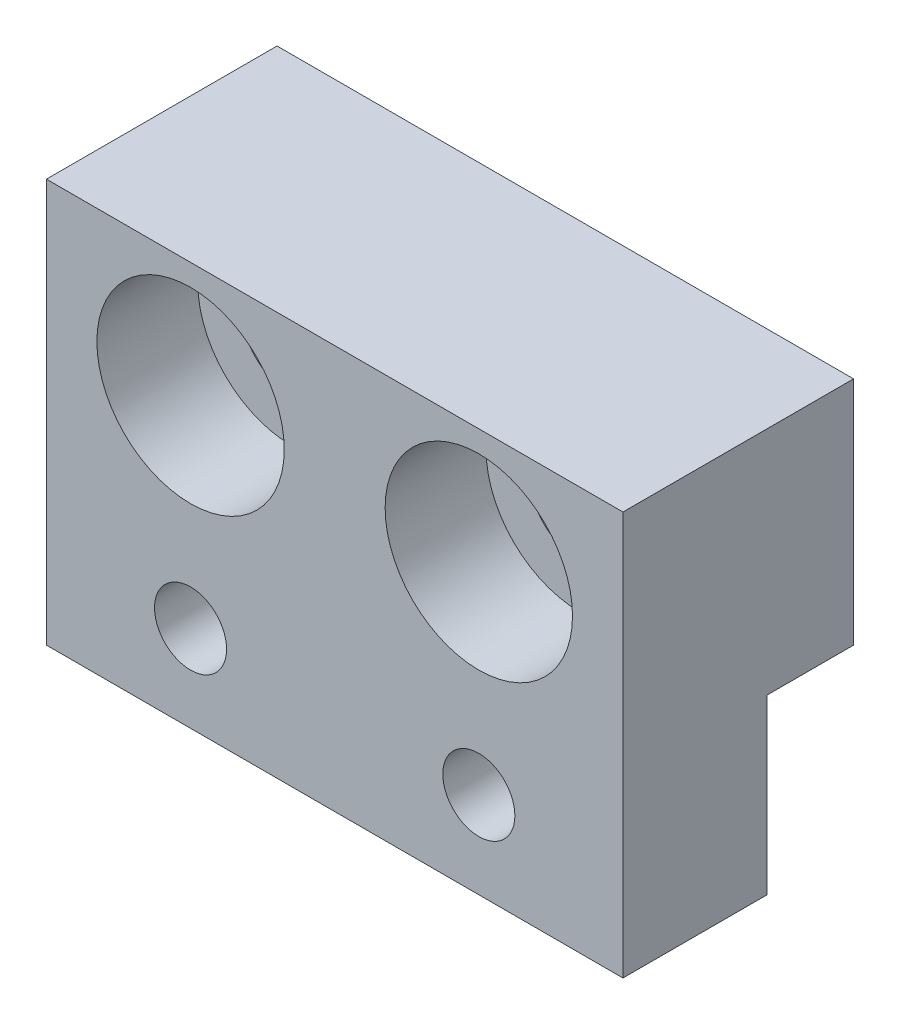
ISO-10303-21;
HEADER;
FILE_DESCRIPTION(('STEP AP214'),'2;1');
FILE_NAME('part.step','',(''),(''),'','','');
FILE_SCHEMA(('AUTOMOTIVE_DESIGN { 1 0 10303 214 1 1 1 1 }'));
ENDSEC;
DATA;
#1=APPLICATION_CONTEXT('core data for automotive mechanical design processes');
#2=APPLICATION_PROTOCOL_DEFINITION('international standard','automotive_design',2000,#1);
#3=PRODUCT_CONTEXT('',#1,'mechanical');
#4=PRODUCT('Part','Part','',(#3));
#5=PRODUCT_RELATED_PRODUCT_CATEGORY('part','',(#4));
#6=PRODUCT_DEFINITION_FORMATION('','',#4);
#7=PRODUCT_DEFINITION_CONTEXT('part definition',#1,'design');
#8=PRODUCT_DEFINITION('design','',#6,#7);
#9=PRODUCT_DEFINITION_SHAPE('','',#8);
#10=(LENGTH_UNIT() NAMED_UNIT(*) SI_UNIT(.MILLI.,.METRE.));
#11=(NAMED_UNIT(*) PLANE_ANGLE_UNIT() SI_UNIT($,.RADIAN.));
#12=(NAMED_UNIT(*) SI_UNIT($,.STERADIAN.) SOLID_ANGLE_UNIT());
#13=UNCERTAINTY_MEASURE_WITH_UNIT(LENGTH_MEASURE(1.E-05),#10,'distance_accuracy_value','');
#14=(GEOMETRIC_REPRESENTATION_CONTEXT(3) GLOBAL_UNCERTAINTY_ASSIGNED_CONTEXT((#13)) GLOBAL_UNIT_ASSIGNED_CONTEXT((#10,
#11,#12)) REPRESENTATION_CONTEXT('',''));
#15=CARTESIAN_POINT('',(0.,0.,0.));
#16=DIRECTION('',(0.,0.,1.));
#17=DIRECTION('',(1.,0.,0.));
#18=AXIS2_PLACEMENT_3D('',#15,#16,#17);
#19=CARTESIAN_POINT('',(4.54747350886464E-13,14.,0.));
#20=DIRECTION('',(0.,0.,-1.));
#21=DIRECTION('',(-1.,0.,0.));
#22=AXIS2_PLACEMENT_3D('',#19,#20,#21);
#23=PLANE('',#22);
#24=CARTESIAN_POINT('',(5.00000000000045,10.0000000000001,0.));
#25=DIRECTION('',(0.,0.,1.));
#26=DIRECTION('',(1.,0.,0.));
#27=AXIS2_PLACEMENT_3D('',#24,#25,#26);
#28=CIRCLE('',#27,1.75);
#29=CARTESIAN_POINT('',(6.75000000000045,10.0000000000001,0.));
#30=VERTEX_POINT('',#29);
#31=EDGE_CURVE('E145',#30,#30,#28,.T.);
#32=ORIENTED_EDGE('',*,*,#31,.T.);
#33=EDGE_LOOP('',(#32));
#34=FACE_BOUND('',#33,.T.);
#35=CARTESIAN_POINT('',(15.0000000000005,10.0000000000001,0.));
#36=DIRECTION('',(0.,0.,1.));
#37=DIRECTION('',(1.,0.,0.));
#38=AXIS2_PLACEMENT_3D('',#35,#36,#37);
#39=CIRCLE('',#38,1.75);
#40=CARTESIAN_POINT('',(16.7500000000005,10.0000000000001,0.));
#41=VERTEX_POINT('',#40);
#42=EDGE_CURVE('E148',#41,#41,#39,.T.);
#43=ORIENTED_EDGE('',*,*,#42,.T.);
#44=EDGE_LOOP('',(#43));
#45=FACE_BOUND('',#44,.T.);
#46=DIRECTION('',(0.,1.,0.));
#47=VECTOR('',#46,1.);
#48=CARTESIAN_POINT('',(20.0000000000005,0.,0.));
#49=LINE('',#48,#47);
#50=CARTESIAN_POINT('',(20.0000000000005,5.99999999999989,0.));
#51=VERTEX_POINT('',#50);
#52=CARTESIAN_POINT('',(20.0000000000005,14.,0.));
#53=VERTEX_POINT('',#52);
#54=EDGE_CURVE('E159',#51,#53,#49,.T.);
#55=ORIENTED_EDGE('',*,*,#54,.F.);
#56=DIRECTION('',(1.,0.,0.));
#57=VECTOR('',#56,1.);
#58=CARTESIAN_POINT('',(4.54497550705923E-13,5.99999999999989,0.));
#59=LINE('',#58,#57);
#60=CARTESIAN_POINT('',(4.54497550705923E-13,5.99999999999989,0.));
#61=VERTEX_POINT('',#60);
#62=EDGE_CURVE('E102',#61,#51,#59,.T.);
#63=ORIENTED_EDGE('',*,*,#62,.F.);
#64=DIRECTION('',(0.,-1.,0.));
#65=VECTOR('',#64,1.);
#66=CARTESIAN_POINT('',(4.54747350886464E-13,0.,0.));
#67=LINE('',#66,#65);
#68=CARTESIAN_POINT('',(4.54747350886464E-13,14.,0.));
#69=VERTEX_POINT('',#68);
#70=EDGE_CURVE('E114',#69,#61,#67,.T.);
#71=ORIENTED_EDGE('',*,*,#70,.F.);
#72=DIRECTION('',(-1.,0.,0.));
#73=VECTOR('',#72,1.);
#74=CARTESIAN_POINT('',(4.54747350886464E-13,14.,0.));
#75=LINE('',#74,#73);
#76=EDGE_CURVE('E74',#53,#69,#75,.T.);
#77=ORIENTED_EDGE('',*,*,#76,.F.);
#78=EDGE_LOOP('',(#55,#63,#71,#77));
#79=FACE_BOUND('',#78,.T.);
#80=ADVANCED_FACE('F33',(#34,#45,#79),#23,.T.);
#81=CARTESIAN_POINT('',(4.54747350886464E-13,0.,8.));
#82=DIRECTION('',(1.,0.,0.));
#83=DIRECTION('',(0.,0.,-1.));
#84=AXIS2_PLACEMENT_3D('',#81,#82,#83);
#85=PLANE('',#84);
#86=DIRECTION('',(0.,0.,-1.));
#87=VECTOR('',#86,1.);
#88=CARTESIAN_POINT('',(4.54497550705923E-13,5.99999999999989,3.));
#89=LINE('',#88,#87);
#90=CARTESIAN_POINT('',(4.54497550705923E-13,5.99999999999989,3.));
#91=VERTEX_POINT('',#90);
#92=EDGE_CURVE('E98',#91,#61,#89,.T.);
#93=ORIENTED_EDGE('',*,*,#92,.F.);
#94=DIRECTION('',(0.,1.,0.));
#95=VECTOR('',#94,1.);
#96=CARTESIAN_POINT('',(4.54497550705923E-13,-1.13686837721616E-13,3.));
#97=LINE('',#96,#95);
#98=CARTESIAN_POINT('',(4.54497550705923E-13,-1.13624387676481E-13,3.));
#99=VERTEX_POINT('',#98);
#100=EDGE_CURVE('E106',#99,#91,#97,.T.);
#101=ORIENTED_EDGE('',*,*,#100,.F.);
#102=DIRECTION('',(0.,0.,-1.));
#103=VECTOR('',#102,1.);
#104=CARTESIAN_POINT('',(4.54747350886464E-13,0.,8.));
#105=LINE('',#104,#103);
#106=CARTESIAN_POINT('',(4.54747350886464E-13,0.,8.));
#107=VERTEX_POINT('',#106);
#108=EDGE_CURVE('E12',#107,#99,#105,.T.);
#109=ORIENTED_EDGE('',*,*,#108,.F.);
#110=DIRECTION('',(0.,-1.,0.));
#111=VECTOR('',#110,1.);
#112=CARTESIAN_POINT('',(4.54747350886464E-13,0.,8.));
#113=LINE('',#112,#111);
#114=CARTESIAN_POINT('',(4.54747350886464E-13,14.,8.));
#115=VERTEX_POINT('',#114);
#116=EDGE_CURVE('E151',#115,#107,#113,.T.);
#117=ORIENTED_EDGE('',*,*,#116,.F.);
#118=DIRECTION('',(0.,0.,-1.));
#119=VECTOR('',#118,1.);
#120=CARTESIAN_POINT('',(4.54747350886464E-13,14.,8.));
#121=LINE('',#120,#119);
#122=EDGE_CURVE('E157',#115,#69,#121,.T.);
#123=ORIENTED_EDGE('',*,*,#122,.T.);
#124=ORIENTED_EDGE('',*,*,#70,.T.);
#125=EDGE_LOOP('',(#93,#101,#109,#117,#123,#124));
#126=FACE_BOUND('',#125,.T.);
#127=ADVANCED_FACE('F35',(#126),#85,.F.);
#128=CARTESIAN_POINT('',(4.54747350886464E-13,0.,8.));
#129=DIRECTION('',(0.,1.,0.));
#130=DIRECTION('',(0.,0.,1.));
#131=AXIS2_PLACEMENT_3D('',#128,#129,#130);
#132=PLANE('',#131);
#133=DIRECTION('',(1.,0.,0.));
#134=VECTOR('',#133,1.);
#135=CARTESIAN_POINT('',(4.54497550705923E-13,-1.13686837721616E-13,3.));
#136=LINE('',#135,#134);
#137=CARTESIAN_POINT('',(20.0000000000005,-1.13686837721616E-13,3.));
#138=VERTEX_POINT('',#137);
#139=EDGE_CURVE('E103',#99,#138,#136,.T.);
#140=ORIENTED_EDGE('',*,*,#139,.T.);
#141=DIRECTION('',(0.,0.,-1.));
#142=VECTOR('',#141,1.);
#143=CARTESIAN_POINT('',(20.0000000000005,0.,8.));
#144=LINE('',#143,#142);
#145=CARTESIAN_POINT('',(20.0000000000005,0.,8.));
#146=VERTEX_POINT('',#145);
#147=EDGE_CURVE('E42',#146,#138,#144,.T.);
#148=ORIENTED_EDGE('',*,*,#147,.F.);
#149=DIRECTION('',(1.,0.,0.));
#150=VECTOR('',#149,1.);
#151=CARTESIAN_POINT('',(4.54747350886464E-13,0.,8.));
#152=LINE('',#151,#150);
#153=EDGE_CURVE('E81',#107,#146,#152,.T.);
#154=ORIENTED_EDGE('',*,*,#153,.F.);
#155=ORIENTED_EDGE('',*,*,#108,.T.);
#156=EDGE_LOOP('',(#140,#148,#154,#155));
#157=FACE_BOUND('',#156,.T.);
#158=ADVANCED_FACE('F221',(#157),#132,.F.);
#159=CARTESIAN_POINT('',(20.0000000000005,0.,8.));
#160=DIRECTION('',(-1.,0.,0.));
#161=DIRECTION('',(0.,0.,1.));
#162=AXIS2_PLACEMENT_3D('',#159,#160,#161);
#163=PLANE('',#162);
#164=DIRECTION('',(0.,0.,-1.));
#165=VECTOR('',#164,1.);
#166=CARTESIAN_POINT('',(20.0000000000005,5.99999999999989,3.));
#167=LINE('',#166,#165);
#168=CARTESIAN_POINT('',(20.0000000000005,5.99999999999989,3.));
#169=VERTEX_POINT('',#168);
#170=EDGE_CURVE('E50',#169,#51,#167,.T.);
#171=ORIENTED_EDGE('',*,*,#170,.T.);
#172=ORIENTED_EDGE('',*,*,#54,.T.);
#173=DIRECTION('',(0.,0.,-1.));
#174=VECTOR('',#173,1.);
#175=CARTESIAN_POINT('',(20.0000000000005,14.,8.));
#176=LINE('',#175,#174);
#177=CARTESIAN_POINT('',(20.0000000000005,14.,8.));
#178=VERTEX_POINT('',#177);
#179=EDGE_CURVE('E163',#178,#53,#176,.T.);
#180=ORIENTED_EDGE('',*,*,#179,.F.);
#181=DIRECTION('',(0.,1.,0.));
#182=VECTOR('',#181,1.);
#183=CARTESIAN_POINT('',(20.0000000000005,0.,8.));
#184=LINE('',#183,#182);
#185=EDGE_CURVE('E154',#146,#178,#184,.T.);
#186=ORIENTED_EDGE('',*,*,#185,.F.);
#187=ORIENTED_EDGE('',*,*,#147,.T.);
#188=DIRECTION('',(0.,1.,0.));
#189=VECTOR('',#188,1.);
#190=CARTESIAN_POINT('',(20.0000000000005,-1.13686837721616E-13,3.));
#191=LINE('',#190,#189);
#192=EDGE_CURVE('E118',#138,#169,#191,.T.);
#193=ORIENTED_EDGE('',*,*,#192,.T.);
#194=EDGE_LOOP('',(#171,#172,#180,#186,#187,#193));
#195=FACE_BOUND('',#194,.T.);
#196=ADVANCED_FACE('F228',(#195),#163,.F.);
#197=CARTESIAN_POINT('',(5.00000000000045,3.,8.));
#198=DIRECTION('',(0.,0.,-1.));
#199=DIRECTION('',(-1.,0.,0.));
#200=AXIS2_PLACEMENT_3D('',#197,#198,#199);
#201=CYLINDRICAL_SURFACE('',#200,1.25);
#202=CARTESIAN_POINT('',(5.00000000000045,3.,8.));
#203=DIRECTION('',(0.,0.,1.));
#204=DIRECTION('',(1.,0.,0.));
#205=AXIS2_PLACEMENT_3D('',#202,#203,#204);
#206=CIRCLE('',#205,1.25);
#207=CARTESIAN_POINT('',(6.25000000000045,3.,8.));
#208=VERTEX_POINT('',#207);
#209=EDGE_CURVE('E142',#208,#208,#206,.T.);
#210=ORIENTED_EDGE('',*,*,#209,.T.);
#211=EDGE_LOOP('',(#210));
#212=FACE_BOUND('',#211,.T.);
#213=CARTESIAN_POINT('',(5.00000000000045,3.,3.));
#214=DIRECTION('',(0.,0.,-1.));
#215=DIRECTION('',(-1.,0.,0.));
#216=AXIS2_PLACEMENT_3D('',#213,#214,#215);
#217=CIRCLE('',#216,1.25);
#218=CARTESIAN_POINT('',(3.75000000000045,3.,3.));
#219=VERTEX_POINT('',#218);
#220=EDGE_CURVE('E122',#219,#219,#217,.T.);
#221=ORIENTED_EDGE('',*,*,#220,.T.);
#222=EDGE_LOOP('',(#221));
#223=FACE_BOUND('',#222,.T.);
#224=ADVANCED_FACE('F202',(#212,#223),#201,.F.);
#225=CARTESIAN_POINT('',(15.0000000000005,3.,8.));
#226=DIRECTION('',(0.,0.,-1.));
#227=DIRECTION('',(-1.,0.,0.));
#228=AXIS2_PLACEMENT_3D('',#225,#226,#227);
#229=CYLINDRICAL_SURFACE('',#228,1.25);
#230=CARTESIAN_POINT('',(15.0000000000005,3.,8.));
#231=DIRECTION('',(0.,0.,1.));
#232=DIRECTION('',(1.,0.,0.));
#233=AXIS2_PLACEMENT_3D('',#230,#231,#232);
#234=CIRCLE('',#233,1.25);
#235=CARTESIAN_POINT('',(16.2500000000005,3.,8.));
#236=VERTEX_POINT('',#235);
#237=EDGE_CURVE('E139',#236,#236,#234,.T.);
#238=ORIENTED_EDGE('',*,*,#237,.T.);
#239=EDGE_LOOP('',(#238));
#240=FACE_BOUND('',#239,.T.);
#241=CARTESIAN_POINT('',(15.0000000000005,3.,3.));
#242=DIRECTION('',(0.,0.,-1.));
#243=DIRECTION('',(-1.,0.,0.));
#244=AXIS2_PLACEMENT_3D('',#241,#242,#243);
#245=CIRCLE('',#244,1.25);
#246=CARTESIAN_POINT('',(13.7500000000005,3.,3.));
#247=VERTEX_POINT('',#246);
#248=EDGE_CURVE('E37',#247,#247,#245,.T.);
#249=ORIENTED_EDGE('',*,*,#248,.T.);
#250=EDGE_LOOP('',(#249));
#251=FACE_BOUND('',#250,.T.);
#252=ADVANCED_FACE('F199',(#240,#251),#229,.F.);
#253=CARTESIAN_POINT('',(5.00000000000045,10.0000000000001,8.));
#254=DIRECTION('',(0.,0.,-1.));
#255=DIRECTION('',(-1.,0.,0.));
#256=AXIS2_PLACEMENT_3D('',#253,#254,#255);
#257=CYLINDRICAL_SURFACE('',#256,1.75);
#258=ORIENTED_EDGE('',*,*,#31,.F.);
#259=EDGE_LOOP('',(#258));
#260=FACE_BOUND('',#259,.T.);
#261=CARTESIAN_POINT('',(5.00000000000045,10.0000000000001,4.5));
#262=DIRECTION('',(0.,0.,1.));
#263=DIRECTION('',(1.,0.,0.));
#264=AXIS2_PLACEMENT_3D('',#261,#262,#263);
#265=CIRCLE('',#264,1.75);
#266=CARTESIAN_POINT('',(6.75000000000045,10.0000000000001,4.5));
#267=VERTEX_POINT('',#266);
#268=EDGE_CURVE('E129',#267,#267,#265,.T.);
#269=ORIENTED_EDGE('',*,*,#268,.T.);
#270=EDGE_LOOP('',(#269));
#271=FACE_BOUND('',#270,.T.);
#272=ADVANCED_FACE('F171',(#260,#271),#257,.F.);
#273=CARTESIAN_POINT('',(15.0000000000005,10.0000000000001,8.));
#274=DIRECTION('',(0.,0.,-1.));
#275=DIRECTION('',(-1.,0.,0.));
#276=AXIS2_PLACEMENT_3D('',#273,#274,#275);
#277=CYLINDRICAL_SURFACE('',#276,1.75);
#278=ORIENTED_EDGE('',*,*,#42,.F.);
#279=EDGE_LOOP('',(#278));
#280=FACE_BOUND('',#279,.T.);
#281=CARTESIAN_POINT('',(15.0000000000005,10.0000000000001,4.5));
#282=DIRECTION('',(0.,0.,1.));
#283=DIRECTION('',(1.,0.,0.));
#284=AXIS2_PLACEMENT_3D('',#281,#282,#283);
#285=CIRCLE('',#284,1.75);
#286=CARTESIAN_POINT('',(16.7500000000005,10.0000000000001,4.5));
#287=VERTEX_POINT('',#286);
#288=EDGE_CURVE('E135',#287,#287,#285,.T.);
#289=ORIENTED_EDGE('',*,*,#288,.T.);
#290=EDGE_LOOP('',(#289));
#291=FACE_BOUND('',#290,.T.);
#292=ADVANCED_FACE('F190',(#280,#291),#277,.F.);
#293=CARTESIAN_POINT('',(4.54747350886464E-13,14.,8.));
#294=DIRECTION('',(0.,0.,-1.));
#295=DIRECTION('',(-1.,0.,0.));
#296=AXIS2_PLACEMENT_3D('',#293,#294,#295);
#297=PLANE('',#296);
#298=CARTESIAN_POINT('',(5.00000000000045,10.0000000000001,8.));
#299=DIRECTION('',(0.,0.,1.));
#300=DIRECTION('',(1.,0.,0.));
#301=AXIS2_PLACEMENT_3D('',#298,#299,#300);
#302=CIRCLE('',#301,3.25);
#303=CARTESIAN_POINT('',(8.25000000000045,10.0000000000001,8.));
#304=VERTEX_POINT('',#303);
#305=EDGE_CURVE('E125',#304,#304,#302,.T.);
#306=ORIENTED_EDGE('',*,*,#305,.F.);
#307=EDGE_LOOP('',(#306));
#308=FACE_BOUND('',#307,.T.);
#309=CARTESIAN_POINT('',(15.0000000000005,10.0000000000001,8.));
#310=DIRECTION('',(0.,0.,1.));
#311=DIRECTION('',(1.,0.,0.));
#312=AXIS2_PLACEMENT_3D('',#309,#310,#311);
#313=CIRCLE('',#312,3.25);
#314=CARTESIAN_POINT('',(18.2500000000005,10.0000000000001,8.));
#315=VERTEX_POINT('',#314);
#316=EDGE_CURVE('E136',#315,#315,#313,.T.);
#317=ORIENTED_EDGE('',*,*,#316,.F.);
#318=EDGE_LOOP('',(#317));
#319=FACE_BOUND('',#318,.T.);
#320=ORIENTED_EDGE('',*,*,#209,.F.);
#321=EDGE_LOOP('',(#320));
#322=FACE_BOUND('',#321,.T.);
#323=ORIENTED_EDGE('',*,*,#116,.T.);
#324=ORIENTED_EDGE('',*,*,#153,.T.);
#325=ORIENTED_EDGE('',*,*,#185,.T.);
#326=DIRECTION('',(-1.,0.,0.));
#327=VECTOR('',#326,1.);
#328=CARTESIAN_POINT('',(4.54747350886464E-13,14.,8.));
#329=LINE('',#328,#327);
#330=EDGE_CURVE('E59',#178,#115,#329,.T.);
#331=ORIENTED_EDGE('',*,*,#330,.T.);
#332=EDGE_LOOP('',(#323,#324,#325,#331));
#333=FACE_BOUND('',#332,.T.);
#334=ORIENTED_EDGE('',*,*,#237,.F.);
#335=EDGE_LOOP('',(#334));
#336=FACE_BOUND('',#335,.T.);
#337=ADVANCED_FACE('F186',(#308,#319,#322,#333,#336),#297,.F.);
#338=CARTESIAN_POINT('',(4.54747350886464E-13,14.,8.));
#339=DIRECTION('',(0.,-1.,0.));
#340=DIRECTION('',(0.,0.,-1.));
#341=AXIS2_PLACEMENT_3D('',#338,#339,#340);
#342=PLANE('',#341);
#343=ORIENTED_EDGE('',*,*,#76,.T.);
#344=ORIENTED_EDGE('',*,*,#122,.F.);
#345=ORIENTED_EDGE('',*,*,#330,.F.);
#346=ORIENTED_EDGE('',*,*,#179,.T.);
#347=EDGE_LOOP('',(#343,#344,#345,#346));
#348=FACE_BOUND('',#347,.T.);
#349=ADVANCED_FACE('F189',(#348),#342,.F.);
#350=CARTESIAN_POINT('',(15.0000000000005,10.0000000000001,4.5));
#351=DIRECTION('',(0.,0.,1.));
#352=DIRECTION('',(1.,0.,0.));
#353=AXIS2_PLACEMENT_3D('',#350,#351,#352);
#354=CYLINDRICAL_SURFACE('',#353,3.25);
#355=CARTESIAN_POINT('',(15.0000000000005,10.0000000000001,4.5));
#356=DIRECTION('',(0.,0.,1.));
#357=DIRECTION('',(1.,0.,0.));
#358=AXIS2_PLACEMENT_3D('',#355,#356,#357);
#359=CIRCLE('',#358,3.25);
#360=CARTESIAN_POINT('',(18.2500000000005,10.0000000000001,4.5));
#361=VERTEX_POINT('',#360);
#362=EDGE_CURVE('E132',#361,#361,#359,.T.);
#363=ORIENTED_EDGE('',*,*,#362,.F.);
#364=EDGE_LOOP('',(#363));
#365=FACE_BOUND('',#364,.T.);
#366=ORIENTED_EDGE('',*,*,#316,.T.);
#367=EDGE_LOOP('',(#366));
#368=FACE_BOUND('',#367,.T.);
#369=ADVANCED_FACE('F227',(#365,#368),#354,.F.);
#370=CARTESIAN_POINT('',(15.0000000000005,10.0000000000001,4.5));
#371=DIRECTION('',(0.,0.,1.));
#372=DIRECTION('',(1.,0.,0.));
#373=AXIS2_PLACEMENT_3D('',#370,#371,#372);
#374=PLANE('',#373);
#375=ORIENTED_EDGE('',*,*,#288,.F.);
#376=EDGE_LOOP('',(#375));
#377=FACE_BOUND('',#376,.T.);
#378=ORIENTED_EDGE('',*,*,#362,.T.);
#379=EDGE_LOOP('',(#378));
#380=FACE_BOUND('',#379,.T.);
#381=ADVANCED_FACE('F182',(#377,#380),#374,.T.);
#382=CARTESIAN_POINT('',(5.00000000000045,10.0000000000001,4.5));
#383=DIRECTION('',(0.,0.,1.));
#384=DIRECTION('',(1.,0.,0.));
#385=AXIS2_PLACEMENT_3D('',#382,#383,#384);
#386=CYLINDRICAL_SURFACE('',#385,3.25);
#387=CARTESIAN_POINT('',(5.00000000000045,10.0000000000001,4.5));
#388=DIRECTION('',(0.,0.,1.));
#389=DIRECTION('',(1.,0.,0.));
#390=AXIS2_PLACEMENT_3D('',#387,#388,#389);
#391=CIRCLE('',#390,3.25);
#392=CARTESIAN_POINT('',(8.25000000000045,10.0000000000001,4.5));
#393=VERTEX_POINT('',#392);
#394=EDGE_CURVE('E126',#393,#393,#391,.T.);
#395=ORIENTED_EDGE('',*,*,#394,.F.);
#396=EDGE_LOOP('',(#395));
#397=FACE_BOUND('',#396,.T.);
#398=ORIENTED_EDGE('',*,*,#305,.T.);
#399=EDGE_LOOP('',(#398));
#400=FACE_BOUND('',#399,.T.);
#401=ADVANCED_FACE('F176',(#397,#400),#386,.F.);
#402=CARTESIAN_POINT('',(5.00000000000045,10.0000000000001,4.5));
#403=DIRECTION('',(0.,0.,1.));
#404=DIRECTION('',(1.,0.,0.));
#405=AXIS2_PLACEMENT_3D('',#402,#403,#404);
#406=PLANE('',#405);
#407=ORIENTED_EDGE('',*,*,#268,.F.);
#408=EDGE_LOOP('',(#407));
#409=FACE_BOUND('',#408,.T.);
#410=ORIENTED_EDGE('',*,*,#394,.T.);
#411=EDGE_LOOP('',(#410));
#412=FACE_BOUND('',#411,.T.);
#413=ADVANCED_FACE('F173',(#409,#412),#406,.T.);
#414=CARTESIAN_POINT('',(4.54497550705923E-13,5.99999999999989,3.));
#415=DIRECTION('',(0.,-1.,0.));
#416=DIRECTION('',(0.,0.,-1.));
#417=AXIS2_PLACEMENT_3D('',#414,#415,#416);
#418=PLANE('',#417);
#419=ORIENTED_EDGE('',*,*,#170,.F.);
#420=DIRECTION('',(1.,0.,0.));
#421=VECTOR('',#420,1.);
#422=CARTESIAN_POINT('',(4.54497550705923E-13,5.99999999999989,3.));
#423=LINE('',#422,#421);
#424=EDGE_CURVE('E94',#91,#169,#423,.T.);
#425=ORIENTED_EDGE('',*,*,#424,.F.);
#426=ORIENTED_EDGE('',*,*,#92,.T.);
#427=ORIENTED_EDGE('',*,*,#62,.T.);
#428=EDGE_LOOP('',(#419,#425,#426,#427));
#429=FACE_BOUND('',#428,.T.);
#430=ADVANCED_FACE('F96',(#429),#418,.T.);
#431=CARTESIAN_POINT('',(4.54497550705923E-13,-1.13686837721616E-13,3.));
#432=DIRECTION('',(0.,0.,-1.));
#433=DIRECTION('',(-1.,0.,0.));
#434=AXIS2_PLACEMENT_3D('',#431,#432,#433);
#435=PLANE('',#434);
#436=ORIENTED_EDGE('',*,*,#220,.F.);
#437=EDGE_LOOP('',(#436));
#438=FACE_BOUND('',#437,.T.);
#439=ORIENTED_EDGE('',*,*,#248,.F.);
#440=EDGE_LOOP('',(#439));
#441=FACE_BOUND('',#440,.T.);
#442=ORIENTED_EDGE('',*,*,#192,.F.);
#443=ORIENTED_EDGE('',*,*,#139,.F.);
#444=ORIENTED_EDGE('',*,*,#100,.T.);
#445=ORIENTED_EDGE('',*,*,#424,.T.);
#446=EDGE_LOOP('',(#442,#443,#444,#445));
#447=FACE_BOUND('',#446,.T.);
#448=ADVANCED_FACE('F107',(#438,#441,#447),#435,.T.);
#449=CLOSED_SHELL('',(#80,#127,#158,#196,#224,#252,#272,#292,#337,#349,#369,#381,#401,#413,#430,#448));
#450=MANIFOLD_SOLID_BREP('B2',#449);
#451=ADVANCED_BREP_SHAPE_REPRESENTATION('',(#18,#450),#14);
#452=SHAPE_DEFINITION_REPRESENTATION(#9,#451);
ENDSEC;
END-ISO-10303-21;
